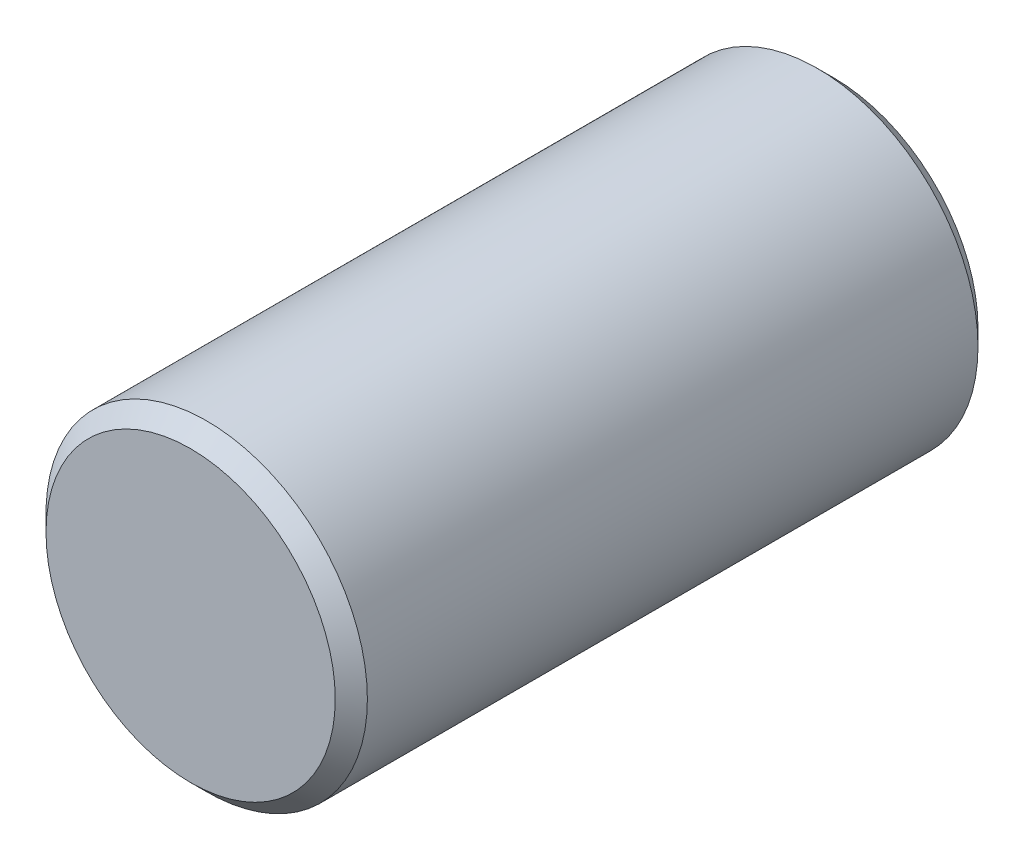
ISO-10303-21;
HEADER;
FILE_DESCRIPTION(('STEP AP214'),'2;1');
FILE_NAME('part.step','',(''),(''),'','','');
FILE_SCHEMA(('AUTOMOTIVE_DESIGN { 1 0 10303 214 1 1 1 1 }'));
ENDSEC;
DATA;
#1=APPLICATION_CONTEXT('core data for automotive mechanical design processes');
#2=APPLICATION_PROTOCOL_DEFINITION('international standard','automotive_design',2000,#1);
#3=PRODUCT_CONTEXT('',#1,'mechanical');
#4=PRODUCT('Part','Part','',(#3));
#5=PRODUCT_RELATED_PRODUCT_CATEGORY('part','',(#4));
#6=PRODUCT_DEFINITION_FORMATION('','',#4);
#7=PRODUCT_DEFINITION_CONTEXT('part definition',#1,'design');
#8=PRODUCT_DEFINITION('design','',#6,#7);
#9=PRODUCT_DEFINITION_SHAPE('','',#8);
#10=(LENGTH_UNIT() NAMED_UNIT(*) SI_UNIT(.MILLI.,.METRE.));
#11=(NAMED_UNIT(*) PLANE_ANGLE_UNIT() SI_UNIT($,.RADIAN.));
#12=(NAMED_UNIT(*) SI_UNIT($,.STERADIAN.) SOLID_ANGLE_UNIT());
#13=UNCERTAINTY_MEASURE_WITH_UNIT(LENGTH_MEASURE(1.E-05),#10,'distance_accuracy_value','');
#14=(GEOMETRIC_REPRESENTATION_CONTEXT(3) GLOBAL_UNCERTAINTY_ASSIGNED_CONTEXT((#13)) GLOBAL_UNIT_ASSIGNED_CONTEXT((#10,
#11,#12)) REPRESENTATION_CONTEXT('',''));
#15=CARTESIAN_POINT('',(0.,0.,0.));
#16=DIRECTION('',(0.,0.,1.));
#17=DIRECTION('',(1.,0.,0.));
#18=AXIS2_PLACEMENT_3D('',#15,#16,#17);
#19=CARTESIAN_POINT('',(0.,0.,8.));
#20=DIRECTION('',(0.,0.,-1.));
#21=DIRECTION('',(-1.,0.,0.));
#22=AXIS2_PLACEMENT_3D('',#19,#20,#21);
#23=CYLINDRICAL_SURFACE('',#22,2.);
#24=CARTESIAN_POINT('',(0.,0.,7.8));
#25=DIRECTION('',(0.,0.,1.));
#26=DIRECTION('',(1.,0.,0.));
#27=AXIS2_PLACEMENT_3D('',#24,#25,#26);
#28=CIRCLE('',#27,2.);
#29=CARTESIAN_POINT('',(2.,0.,7.8));
#30=VERTEX_POINT('',#29);
#31=EDGE_CURVE('E42',#30,#30,#28,.F.);
#32=ORIENTED_EDGE('',*,*,#31,.T.);
#33=EDGE_LOOP('',(#32));
#34=FACE_BOUND('',#33,.T.);
#35=CARTESIAN_POINT('',(0.,0.,0.199999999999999));
#36=DIRECTION('',(0.,0.,1.));
#37=DIRECTION('',(1.,0.,0.));
#38=AXIS2_PLACEMENT_3D('',#35,#36,#37);
#39=CIRCLE('',#38,2.);
#40=CARTESIAN_POINT('',(2.,0.,0.199999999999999));
#41=VERTEX_POINT('',#40);
#42=EDGE_CURVE('E46',#41,#41,#39,.T.);
#43=ORIENTED_EDGE('',*,*,#42,.T.);
#44=EDGE_LOOP('',(#43));
#45=FACE_BOUND('',#44,.T.);
#46=ADVANCED_FACE('F36',(#34,#45),#23,.T.);
#47=CARTESIAN_POINT('',(0.,0.,8.));
#48=DIRECTION('',(0.,0.,1.));
#49=DIRECTION('',(1.,0.,0.));
#50=AXIS2_PLACEMENT_3D('',#47,#48,#49);
#51=PLANE('',#50);
#52=CARTESIAN_POINT('',(0.,0.,8.));
#53=DIRECTION('',(0.,0.,1.));
#54=DIRECTION('',(1.,0.,0.));
#55=AXIS2_PLACEMENT_3D('',#52,#53,#54);
#56=CIRCLE('',#55,1.8);
#57=CARTESIAN_POINT('',(1.8,0.,8.));
#58=VERTEX_POINT('',#57);
#59=EDGE_CURVE('E50',#58,#58,#56,.T.);
#60=ORIENTED_EDGE('',*,*,#59,.T.);
#61=EDGE_LOOP('',(#60));
#62=FACE_BOUND('',#61,.T.);
#63=ADVANCED_FACE('F58',(#62),#51,.T.);
#64=CARTESIAN_POINT('',(0.,0.,0.));
#65=DIRECTION('',(0.,0.,1.));
#66=DIRECTION('',(1.,0.,0.));
#67=AXIS2_PLACEMENT_3D('',#64,#65,#66);
#68=PLANE('',#67);
#69=CARTESIAN_POINT('',(0.,0.,0.));
#70=DIRECTION('',(0.,0.,1.));
#71=DIRECTION('',(1.,0.,0.));
#72=AXIS2_PLACEMENT_3D('',#69,#70,#71);
#73=CIRCLE('',#72,1.8);
#74=CARTESIAN_POINT('',(1.8,0.,0.));
#75=VERTEX_POINT('',#74);
#76=EDGE_CURVE('E11',#75,#75,#73,.F.);
#77=ORIENTED_EDGE('',*,*,#76,.T.);
#78=EDGE_LOOP('',(#77));
#79=FACE_BOUND('',#78,.T.);
#80=ADVANCED_FACE('F63',(#79),#68,.F.);
#81=CARTESIAN_POINT('',(0.,0.,8.));
#82=DIRECTION('',(0.,0.,-1.));
#83=DIRECTION('',(-1.,0.,0.));
#84=AXIS2_PLACEMENT_3D('',#81,#82,#83);
#85=CONICAL_SURFACE('',#84,1.8,0.785398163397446);
#86=ORIENTED_EDGE('',*,*,#31,.F.);
#87=EDGE_LOOP('',(#86));
#88=FACE_BOUND('',#87,.T.);
#89=ORIENTED_EDGE('',*,*,#59,.F.);
#90=EDGE_LOOP('',(#89));
#91=FACE_BOUND('',#90,.T.);
#92=ADVANCED_FACE('F60',(#88,#91),#85,.T.);
#93=CARTESIAN_POINT('',(0.,0.,0.199999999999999));
#94=DIRECTION('',(0.,0.,1.));
#95=DIRECTION('',(1.,0.,0.));
#96=AXIS2_PLACEMENT_3D('',#93,#94,#95);
#97=CONICAL_SURFACE('',#96,2.,0.78539816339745);
#98=ORIENTED_EDGE('',*,*,#76,.F.);
#99=EDGE_LOOP('',(#98));
#100=FACE_BOUND('',#99,.T.);
#101=ORIENTED_EDGE('',*,*,#42,.F.);
#102=EDGE_LOOP('',(#101));
#103=FACE_BOUND('',#102,.T.);
#104=ADVANCED_FACE('F62',(#100,#103),#97,.T.);
#105=CLOSED_SHELL('',(#46,#63,#80,#92,#104));
#106=MANIFOLD_SOLID_BREP('B2',#105);
#107=ADVANCED_BREP_SHAPE_REPRESENTATION('',(#18,#106),#14);
#108=SHAPE_DEFINITION_REPRESENTATION(#9,#107);
ENDSEC;
END-ISO-10303-21;
